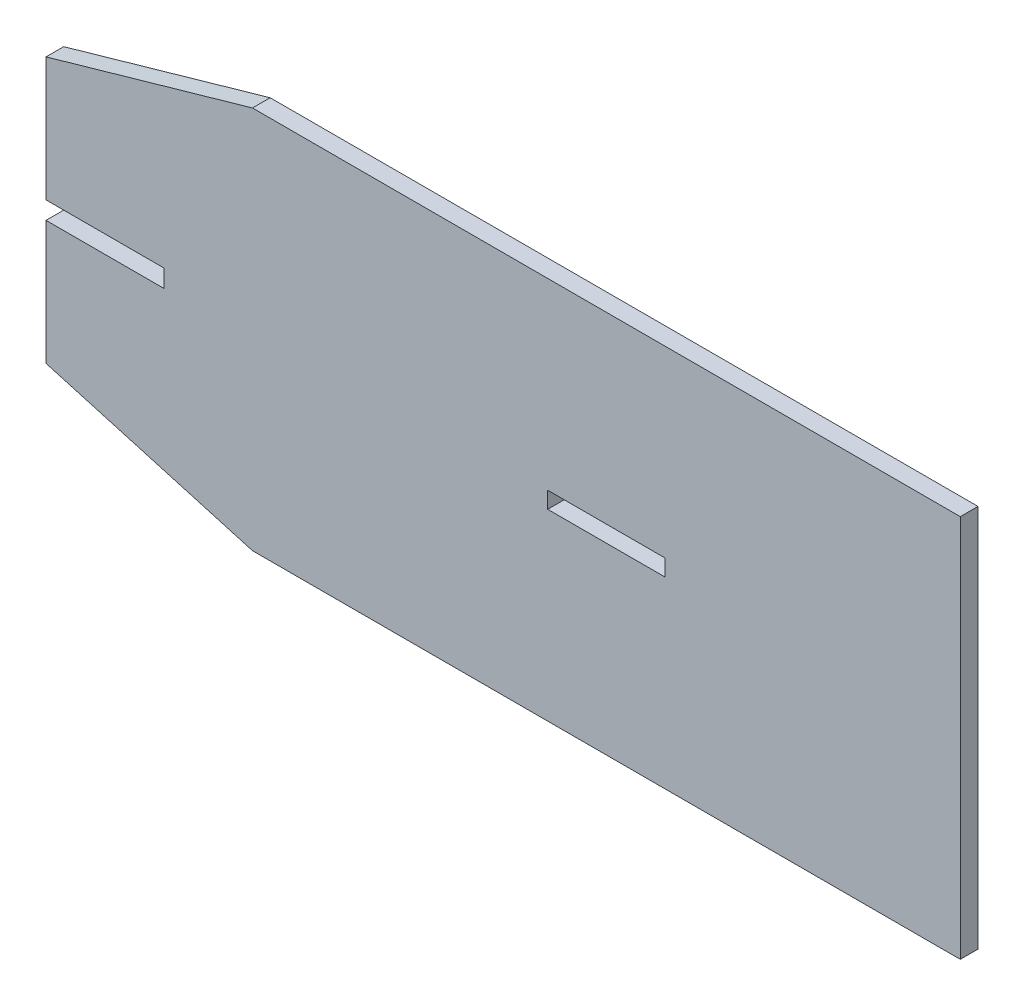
ISO-10303-21;
HEADER;
FILE_DESCRIPTION(('STEP AP214'),'2;1');
FILE_NAME('part.step','',(''),(''),'','','');
FILE_SCHEMA(('AUTOMOTIVE_DESIGN { 1 0 10303 214 1 1 1 1 }'));
ENDSEC;
DATA;
#1=APPLICATION_CONTEXT('core data for automotive mechanical design processes');
#2=APPLICATION_PROTOCOL_DEFINITION('international standard','automotive_design',2000,#1);
#3=PRODUCT_CONTEXT('',#1,'mechanical');
#4=PRODUCT('Part','Part','',(#3));
#5=PRODUCT_RELATED_PRODUCT_CATEGORY('part','',(#4));
#6=PRODUCT_DEFINITION_FORMATION('','',#4);
#7=PRODUCT_DEFINITION_CONTEXT('part definition',#1,'design');
#8=PRODUCT_DEFINITION('design','',#6,#7);
#9=PRODUCT_DEFINITION_SHAPE('','',#8);
#10=(LENGTH_UNIT() NAMED_UNIT(*) SI_UNIT(.MILLI.,.METRE.));
#11=(NAMED_UNIT(*) PLANE_ANGLE_UNIT() SI_UNIT($,.RADIAN.));
#12=(NAMED_UNIT(*) SI_UNIT($,.STERADIAN.) SOLID_ANGLE_UNIT());
#13=UNCERTAINTY_MEASURE_WITH_UNIT(LENGTH_MEASURE(1.E-05),#10,'distance_accuracy_value','');
#14=(GEOMETRIC_REPRESENTATION_CONTEXT(3) GLOBAL_UNCERTAINTY_ASSIGNED_CONTEXT((#13)) GLOBAL_UNIT_ASSIGNED_CONTEXT((#10,
#11,#12)) REPRESENTATION_CONTEXT('',''));
#15=CARTESIAN_POINT('',(0.,0.,0.));
#16=DIRECTION('',(0.,0.,1.));
#17=DIRECTION('',(1.,0.,0.));
#18=AXIS2_PLACEMENT_3D('',#15,#16,#17);
#19=CARTESIAN_POINT('',(60.,32.5,3.));
#20=DIRECTION('',(0.,-1.,0.));
#21=DIRECTION('',(1.,0.,0.));
#22=AXIS2_PLACEMENT_3D('',#19,#20,#21);
#23=PLANE('',#22);
#24=DIRECTION('',(-1.,0.,0.));
#25=VECTOR('',#24,1.);
#26=CARTESIAN_POINT('',(60.,32.5,0.));
#27=LINE('',#26,#25);
#28=CARTESIAN_POINT('',(60.,32.5,0.));
#29=VERTEX_POINT('',#28);
#30=CARTESIAN_POINT('',(-60.,32.5,0.));
#31=VERTEX_POINT('',#30);
#32=EDGE_CURVE('E175',#29,#31,#27,.T.);
#33=ORIENTED_EDGE('',*,*,#32,.T.);
#34=DIRECTION('',(0.,0.,-1.));
#35=VECTOR('',#34,1.);
#36=CARTESIAN_POINT('',(-60.,32.5,3.));
#37=LINE('',#36,#35);
#38=CARTESIAN_POINT('',(-60.,32.5,3.));
#39=VERTEX_POINT('',#38);
#40=EDGE_CURVE('E11',#39,#31,#37,.T.);
#41=ORIENTED_EDGE('',*,*,#40,.F.);
#42=DIRECTION('',(-1.,0.,0.));
#43=VECTOR('',#42,1.);
#44=CARTESIAN_POINT('',(60.,32.5,3.));
#45=LINE('',#44,#43);
#46=CARTESIAN_POINT('',(60.,32.5,3.));
#47=VERTEX_POINT('',#46);
#48=EDGE_CURVE('E176',#47,#39,#45,.T.);
#49=ORIENTED_EDGE('',*,*,#48,.F.);
#50=DIRECTION('',(0.,0.,-1.));
#51=VECTOR('',#50,1.);
#52=CARTESIAN_POINT('',(60.,32.5,3.));
#53=LINE('',#52,#51);
#54=EDGE_CURVE('E196',#47,#29,#53,.T.);
#55=ORIENTED_EDGE('',*,*,#54,.T.);
#56=EDGE_LOOP('',(#33,#41,#49,#55));
#57=FACE_BOUND('',#56,.T.);
#58=ADVANCED_FACE('F39',(#57),#23,.F.);
#59=CARTESIAN_POINT('',(-60.,32.5,3.));
#60=DIRECTION('',(0.274721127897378,-0.961523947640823,0.));
#61=DIRECTION('',(0.961523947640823,0.274721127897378,0.));
#62=AXIS2_PLACEMENT_3D('',#59,#60,#61);
#63=PLANE('',#62);
#64=DIRECTION('',(-0.961523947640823,-0.274721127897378,0.));
#65=VECTOR('',#64,1.);
#66=CARTESIAN_POINT('',(-60.,32.5,0.));
#67=LINE('',#66,#65);
#68=CARTESIAN_POINT('',(-95.,22.5,0.));
#69=VERTEX_POINT('',#68);
#70=EDGE_CURVE('E203',#31,#69,#67,.T.);
#71=ORIENTED_EDGE('',*,*,#70,.T.);
#72=DIRECTION('',(0.,0.,-1.));
#73=VECTOR('',#72,1.);
#74=CARTESIAN_POINT('',(-95.,22.5,3.));
#75=LINE('',#74,#73);
#76=CARTESIAN_POINT('',(-95.,22.5,3.));
#77=VERTEX_POINT('',#76);
#78=EDGE_CURVE('E46',#77,#69,#75,.T.);
#79=ORIENTED_EDGE('',*,*,#78,.F.);
#80=DIRECTION('',(-0.961523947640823,-0.274721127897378,0.));
#81=VECTOR('',#80,1.);
#82=CARTESIAN_POINT('',(-60.,32.5,3.));
#83=LINE('',#82,#81);
#84=EDGE_CURVE('E178',#39,#77,#83,.T.);
#85=ORIENTED_EDGE('',*,*,#84,.F.);
#86=ORIENTED_EDGE('',*,*,#40,.T.);
#87=EDGE_LOOP('',(#71,#79,#85,#86));
#88=FACE_BOUND('',#87,.T.);
#89=ADVANCED_FACE('F266',(#88),#63,.F.);
#90=CARTESIAN_POINT('',(-95.,22.5,3.));
#91=DIRECTION('',(1.,0.,0.));
#92=DIRECTION('',(0.,0.,-1.));
#93=AXIS2_PLACEMENT_3D('',#90,#91,#92);
#94=PLANE('',#93);
#95=DIRECTION('',(0.,-1.,0.));
#96=VECTOR('',#95,1.);
#97=CARTESIAN_POINT('',(-95.,22.5,0.));
#98=LINE('',#97,#96);
#99=CARTESIAN_POINT('',(-95.,1.50000000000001,0.));
#100=VERTEX_POINT('',#99);
#101=EDGE_CURVE('E201',#69,#100,#98,.T.);
#102=ORIENTED_EDGE('',*,*,#101,.T.);
#103=DIRECTION('',(0.,0.,-1.));
#104=VECTOR('',#103,1.);
#105=CARTESIAN_POINT('',(-95.,1.50000000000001,3.));
#106=LINE('',#105,#104);
#107=CARTESIAN_POINT('',(-95.,1.50000000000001,3.));
#108=VERTEX_POINT('',#107);
#109=EDGE_CURVE('E236',#108,#100,#106,.T.);
#110=ORIENTED_EDGE('',*,*,#109,.F.);
#111=DIRECTION('',(0.,-1.,0.));
#112=VECTOR('',#111,1.);
#113=CARTESIAN_POINT('',(-95.,22.5,3.));
#114=LINE('',#113,#112);
#115=EDGE_CURVE('E185',#77,#108,#114,.T.);
#116=ORIENTED_EDGE('',*,*,#115,.F.);
#117=ORIENTED_EDGE('',*,*,#78,.T.);
#118=EDGE_LOOP('',(#102,#110,#116,#117));
#119=FACE_BOUND('',#118,.T.);
#120=ADVANCED_FACE('F244',(#119),#94,.F.);
#121=CARTESIAN_POINT('',(-95.,1.50000000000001,3.));
#122=DIRECTION('',(0.,1.,0.));
#123=DIRECTION('',(0.,0.,1.));
#124=AXIS2_PLACEMENT_3D('',#121,#122,#123);
#125=PLANE('',#124);
#126=DIRECTION('',(1.,0.,0.));
#127=VECTOR('',#126,1.);
#128=CARTESIAN_POINT('',(-95.,1.50000000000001,0.));
#129=LINE('',#128,#127);
#130=CARTESIAN_POINT('',(-75.,1.50000000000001,0.));
#131=VERTEX_POINT('',#130);
#132=EDGE_CURVE('E202',#100,#131,#129,.T.);
#133=ORIENTED_EDGE('',*,*,#132,.T.);
#134=DIRECTION('',(0.,0.,-1.));
#135=VECTOR('',#134,1.);
#136=CARTESIAN_POINT('',(-75.,1.50000000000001,3.));
#137=LINE('',#136,#135);
#138=CARTESIAN_POINT('',(-75.,1.50000000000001,3.));
#139=VERTEX_POINT('',#138);
#140=EDGE_CURVE('E234',#139,#131,#137,.T.);
#141=ORIENTED_EDGE('',*,*,#140,.F.);
#142=DIRECTION('',(1.,0.,0.));
#143=VECTOR('',#142,1.);
#144=CARTESIAN_POINT('',(-95.,1.50000000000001,3.));
#145=LINE('',#144,#143);
#146=EDGE_CURVE('E184',#108,#139,#145,.T.);
#147=ORIENTED_EDGE('',*,*,#146,.F.);
#148=ORIENTED_EDGE('',*,*,#109,.T.);
#149=EDGE_LOOP('',(#133,#141,#147,#148));
#150=FACE_BOUND('',#149,.T.);
#151=ADVANCED_FACE('F255',(#150),#125,.F.);
#152=CARTESIAN_POINT('',(-75.,1.50000000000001,3.));
#153=DIRECTION('',(1.,0.,0.));
#154=DIRECTION('',(0.,0.,-1.));
#155=AXIS2_PLACEMENT_3D('',#152,#153,#154);
#156=PLANE('',#155);
#157=DIRECTION('',(0.,-1.,0.));
#158=VECTOR('',#157,1.);
#159=CARTESIAN_POINT('',(-75.,1.50000000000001,0.));
#160=LINE('',#159,#158);
#161=CARTESIAN_POINT('',(-75.,-1.49999999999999,0.));
#162=VERTEX_POINT('',#161);
#163=EDGE_CURVE('E210',#131,#162,#160,.T.);
#164=ORIENTED_EDGE('',*,*,#163,.T.);
#165=DIRECTION('',(0.,0.,-1.));
#166=VECTOR('',#165,1.);
#167=CARTESIAN_POINT('',(-75.,-1.49999999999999,3.));
#168=LINE('',#167,#166);
#169=CARTESIAN_POINT('',(-75.,-1.49999999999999,3.));
#170=VERTEX_POINT('',#169);
#171=EDGE_CURVE('E235',#170,#162,#168,.T.);
#172=ORIENTED_EDGE('',*,*,#171,.F.);
#173=DIRECTION('',(0.,-1.,0.));
#174=VECTOR('',#173,1.);
#175=CARTESIAN_POINT('',(-75.,1.50000000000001,3.));
#176=LINE('',#175,#174);
#177=EDGE_CURVE('E186',#139,#170,#176,.T.);
#178=ORIENTED_EDGE('',*,*,#177,.F.);
#179=ORIENTED_EDGE('',*,*,#140,.T.);
#180=EDGE_LOOP('',(#164,#172,#178,#179));
#181=FACE_BOUND('',#180,.T.);
#182=ADVANCED_FACE('F256',(#181),#156,.F.);
#183=CARTESIAN_POINT('',(-95.,-1.49999999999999,3.));
#184=DIRECTION('',(0.,-1.,0.));
#185=DIRECTION('',(1.,0.,0.));
#186=AXIS2_PLACEMENT_3D('',#183,#184,#185);
#187=PLANE('',#186);
#188=DIRECTION('',(-1.,0.,0.));
#189=VECTOR('',#188,1.);
#190=CARTESIAN_POINT('',(-95.,-1.49999999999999,0.));
#191=LINE('',#190,#189);
#192=CARTESIAN_POINT('',(-95.,-1.49999999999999,0.));
#193=VERTEX_POINT('',#192);
#194=EDGE_CURVE('E207',#162,#193,#191,.T.);
#195=ORIENTED_EDGE('',*,*,#194,.T.);
#196=DIRECTION('',(0.,0.,-1.));
#197=VECTOR('',#196,1.);
#198=CARTESIAN_POINT('',(-95.,-1.49999999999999,3.));
#199=LINE('',#198,#197);
#200=CARTESIAN_POINT('',(-95.,-1.49999999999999,3.));
#201=VERTEX_POINT('',#200);
#202=EDGE_CURVE('E228',#201,#193,#199,.T.);
#203=ORIENTED_EDGE('',*,*,#202,.F.);
#204=DIRECTION('',(-1.,0.,0.));
#205=VECTOR('',#204,1.);
#206=CARTESIAN_POINT('',(-95.,-1.49999999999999,3.));
#207=LINE('',#206,#205);
#208=EDGE_CURVE('E187',#170,#201,#207,.T.);
#209=ORIENTED_EDGE('',*,*,#208,.F.);
#210=ORIENTED_EDGE('',*,*,#171,.T.);
#211=EDGE_LOOP('',(#195,#203,#209,#210));
#212=FACE_BOUND('',#211,.T.);
#213=ADVANCED_FACE('F288',(#212),#187,.F.);
#214=CARTESIAN_POINT('',(-95.,-22.5,3.));
#215=DIRECTION('',(1.,0.,0.));
#216=DIRECTION('',(0.,0.,-1.));
#217=AXIS2_PLACEMENT_3D('',#214,#215,#216);
#218=PLANE('',#217);
#219=DIRECTION('',(0.,-1.,0.));
#220=VECTOR('',#219,1.);
#221=CARTESIAN_POINT('',(-95.,-22.5,0.));
#222=LINE('',#221,#220);
#223=CARTESIAN_POINT('',(-95.,-22.5,0.));
#224=VERTEX_POINT('',#223);
#225=EDGE_CURVE('E211',#193,#224,#222,.T.);
#226=ORIENTED_EDGE('',*,*,#225,.T.);
#227=DIRECTION('',(0.,0.,-1.));
#228=VECTOR('',#227,1.);
#229=CARTESIAN_POINT('',(-95.,-22.5,3.));
#230=LINE('',#229,#228);
#231=CARTESIAN_POINT('',(-95.,-22.5,3.));
#232=VERTEX_POINT('',#231);
#233=EDGE_CURVE('E226',#232,#224,#230,.T.);
#234=ORIENTED_EDGE('',*,*,#233,.F.);
#235=DIRECTION('',(0.,-1.,0.));
#236=VECTOR('',#235,1.);
#237=CARTESIAN_POINT('',(-95.,-22.5,3.));
#238=LINE('',#237,#236);
#239=EDGE_CURVE('E189',#201,#232,#238,.T.);
#240=ORIENTED_EDGE('',*,*,#239,.F.);
#241=ORIENTED_EDGE('',*,*,#202,.T.);
#242=EDGE_LOOP('',(#226,#234,#240,#241));
#243=FACE_BOUND('',#242,.T.);
#244=ADVANCED_FACE('F286',(#243),#218,.F.);
#245=CARTESIAN_POINT('',(-60.,-32.5,3.));
#246=DIRECTION('',(0.274721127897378,0.961523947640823,0.));
#247=DIRECTION('',(-0.961523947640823,0.274721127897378,0.));
#248=AXIS2_PLACEMENT_3D('',#245,#246,#247);
#249=PLANE('',#248);
#250=DIRECTION('',(0.961523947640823,-0.274721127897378,0.));
#251=VECTOR('',#250,1.);
#252=CARTESIAN_POINT('',(-60.,-32.5,0.));
#253=LINE('',#252,#251);
#254=CARTESIAN_POINT('',(-60.,-32.5,0.));
#255=VERTEX_POINT('',#254);
#256=EDGE_CURVE('E213',#224,#255,#253,.T.);
#257=ORIENTED_EDGE('',*,*,#256,.T.);
#258=DIRECTION('',(0.,0.,-1.));
#259=VECTOR('',#258,1.);
#260=CARTESIAN_POINT('',(-60.,-32.5,3.));
#261=LINE('',#260,#259);
#262=CARTESIAN_POINT('',(-60.,-32.5,3.));
#263=VERTEX_POINT('',#262);
#264=EDGE_CURVE('E224',#263,#255,#261,.T.);
#265=ORIENTED_EDGE('',*,*,#264,.F.);
#266=DIRECTION('',(0.961523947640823,-0.274721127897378,0.));
#267=VECTOR('',#266,1.);
#268=CARTESIAN_POINT('',(-60.,-32.5,3.));
#269=LINE('',#268,#267);
#270=EDGE_CURVE('E195',#232,#263,#269,.T.);
#271=ORIENTED_EDGE('',*,*,#270,.F.);
#272=ORIENTED_EDGE('',*,*,#233,.T.);
#273=EDGE_LOOP('',(#257,#265,#271,#272));
#274=FACE_BOUND('',#273,.T.);
#275=ADVANCED_FACE('F285',(#274),#249,.F.);
#276=CARTESIAN_POINT('',(60.,-32.5,3.));
#277=DIRECTION('',(0.,1.,0.));
#278=DIRECTION('',(-1.,0.,0.));
#279=AXIS2_PLACEMENT_3D('',#276,#277,#278);
#280=PLANE('',#279);
#281=DIRECTION('',(1.,0.,0.));
#282=VECTOR('',#281,1.);
#283=CARTESIAN_POINT('',(60.,-32.5,0.));
#284=LINE('',#283,#282);
#285=CARTESIAN_POINT('',(60.,-32.5,0.));
#286=VERTEX_POINT('',#285);
#287=EDGE_CURVE('E214',#255,#286,#284,.T.);
#288=ORIENTED_EDGE('',*,*,#287,.T.);
#289=DIRECTION('',(0.,0.,-1.));
#290=VECTOR('',#289,1.);
#291=CARTESIAN_POINT('',(60.,-32.5,3.));
#292=LINE('',#291,#290);
#293=CARTESIAN_POINT('',(60.,-32.5,3.));
#294=VERTEX_POINT('',#293);
#295=EDGE_CURVE('E219',#294,#286,#292,.T.);
#296=ORIENTED_EDGE('',*,*,#295,.F.);
#297=DIRECTION('',(1.,0.,0.));
#298=VECTOR('',#297,1.);
#299=CARTESIAN_POINT('',(60.,-32.5,3.));
#300=LINE('',#299,#298);
#301=EDGE_CURVE('E193',#263,#294,#300,.T.);
#302=ORIENTED_EDGE('',*,*,#301,.F.);
#303=ORIENTED_EDGE('',*,*,#264,.T.);
#304=EDGE_LOOP('',(#288,#296,#302,#303));
#305=FACE_BOUND('',#304,.T.);
#306=ADVANCED_FACE('F279',(#305),#280,.F.);
#307=CARTESIAN_POINT('',(60.,-32.5,3.));
#308=DIRECTION('',(-1.,0.,0.));
#309=DIRECTION('',(0.,-1.,0.));
#310=AXIS2_PLACEMENT_3D('',#307,#308,#309);
#311=PLANE('',#310);
#312=DIRECTION('',(0.,1.,0.));
#313=VECTOR('',#312,1.);
#314=CARTESIAN_POINT('',(60.,-32.5,0.));
#315=LINE('',#314,#313);
#316=EDGE_CURVE('E179',#286,#29,#315,.T.);
#317=ORIENTED_EDGE('',*,*,#316,.T.);
#318=ORIENTED_EDGE('',*,*,#54,.F.);
#319=DIRECTION('',(0.,1.,0.));
#320=VECTOR('',#319,1.);
#321=CARTESIAN_POINT('',(60.,-32.5,3.));
#322=LINE('',#321,#320);
#323=EDGE_CURVE('E198',#294,#47,#322,.T.);
#324=ORIENTED_EDGE('',*,*,#323,.F.);
#325=ORIENTED_EDGE('',*,*,#295,.T.);
#326=EDGE_LOOP('',(#317,#318,#324,#325));
#327=FACE_BOUND('',#326,.T.);
#328=ADVANCED_FACE('F272',(#327),#311,.F.);
#329=CARTESIAN_POINT('',(0.,0.,3.));
#330=DIRECTION('',(0.,0.,1.));
#331=DIRECTION('',(1.,0.,0.));
#332=AXIS2_PLACEMENT_3D('',#329,#330,#331);
#333=PLANE('',#332);
#334=DIRECTION('',(0.,-1.,0.));
#335=VECTOR('',#334,1.);
#336=CARTESIAN_POINT('',(-9.95,-1.4,3.));
#337=LINE('',#336,#335);
#338=CARTESIAN_POINT('',(-9.95,1.4,3.));
#339=VERTEX_POINT('',#338);
#340=CARTESIAN_POINT('',(-9.95,-1.4,3.));
#341=VERTEX_POINT('',#340);
#342=EDGE_CURVE('E52',#339,#341,#337,.T.);
#343=ORIENTED_EDGE('',*,*,#342,.F.);
#344=DIRECTION('',(-1.,0.,0.));
#345=VECTOR('',#344,1.);
#346=CARTESIAN_POINT('',(9.95,1.4,3.));
#347=LINE('',#346,#345);
#348=CARTESIAN_POINT('',(9.95,1.4,3.));
#349=VERTEX_POINT('',#348);
#350=EDGE_CURVE('E160',#349,#339,#347,.T.);
#351=ORIENTED_EDGE('',*,*,#350,.F.);
#352=DIRECTION('',(0.,1.,0.));
#353=VECTOR('',#352,1.);
#354=CARTESIAN_POINT('',(9.95,-1.4,3.));
#355=LINE('',#354,#353);
#356=CARTESIAN_POINT('',(9.95,-1.4,3.));
#357=VERTEX_POINT('',#356);
#358=EDGE_CURVE('E159',#357,#349,#355,.T.);
#359=ORIENTED_EDGE('',*,*,#358,.F.);
#360=DIRECTION('',(1.,0.,0.));
#361=VECTOR('',#360,1.);
#362=CARTESIAN_POINT('',(9.95,-1.4,3.));
#363=LINE('',#362,#361);
#364=EDGE_CURVE('E167',#341,#357,#363,.T.);
#365=ORIENTED_EDGE('',*,*,#364,.F.);
#366=EDGE_LOOP('',(#343,#351,#359,#365));
#367=FACE_BOUND('',#366,.T.);
#368=ORIENTED_EDGE('',*,*,#48,.T.);
#369=ORIENTED_EDGE('',*,*,#84,.T.);
#370=ORIENTED_EDGE('',*,*,#115,.T.);
#371=ORIENTED_EDGE('',*,*,#146,.T.);
#372=ORIENTED_EDGE('',*,*,#177,.T.);
#373=ORIENTED_EDGE('',*,*,#208,.T.);
#374=ORIENTED_EDGE('',*,*,#239,.T.);
#375=ORIENTED_EDGE('',*,*,#270,.T.);
#376=ORIENTED_EDGE('',*,*,#301,.T.);
#377=ORIENTED_EDGE('',*,*,#323,.T.);
#378=EDGE_LOOP('',(#368,#369,#370,#371,#372,#373,#374,#375,#376,#377));
#379=FACE_BOUND('',#378,.T.);
#380=ADVANCED_FACE('F265',(#367,#379),#333,.T.);
#381=CARTESIAN_POINT('',(0.,0.,0.));
#382=DIRECTION('',(0.,0.,1.));
#383=DIRECTION('',(1.,0.,0.));
#384=AXIS2_PLACEMENT_3D('',#381,#382,#383);
#385=PLANE('',#384);
#386=DIRECTION('',(-1.,0.,0.));
#387=VECTOR('',#386,1.);
#388=CARTESIAN_POINT('',(9.95,1.4,0.));
#389=LINE('',#388,#387);
#390=CARTESIAN_POINT('',(9.95,1.4,0.));
#391=VERTEX_POINT('',#390);
#392=CARTESIAN_POINT('',(-9.95,1.4,0.));
#393=VERTEX_POINT('',#392);
#394=EDGE_CURVE('E150',#391,#393,#389,.T.);
#395=ORIENTED_EDGE('',*,*,#394,.T.);
#396=DIRECTION('',(0.,-1.,0.));
#397=VECTOR('',#396,1.);
#398=CARTESIAN_POINT('',(-9.95,-1.4,0.));
#399=LINE('',#398,#397);
#400=CARTESIAN_POINT('',(-9.95,-1.4,0.));
#401=VERTEX_POINT('',#400);
#402=EDGE_CURVE('E143',#393,#401,#399,.T.);
#403=ORIENTED_EDGE('',*,*,#402,.T.);
#404=DIRECTION('',(1.,0.,0.));
#405=VECTOR('',#404,1.);
#406=CARTESIAN_POINT('',(9.95,-1.4,0.));
#407=LINE('',#406,#405);
#408=CARTESIAN_POINT('',(9.95,-1.4,0.));
#409=VERTEX_POINT('',#408);
#410=EDGE_CURVE('E147',#401,#409,#407,.T.);
#411=ORIENTED_EDGE('',*,*,#410,.T.);
#412=DIRECTION('',(0.,1.,0.));
#413=VECTOR('',#412,1.);
#414=CARTESIAN_POINT('',(9.95,-1.4,0.));
#415=LINE('',#414,#413);
#416=EDGE_CURVE('E61',#409,#391,#415,.T.);
#417=ORIENTED_EDGE('',*,*,#416,.T.);
#418=EDGE_LOOP('',(#395,#403,#411,#417));
#419=FACE_BOUND('',#418,.T.);
#420=ORIENTED_EDGE('',*,*,#32,.F.);
#421=ORIENTED_EDGE('',*,*,#316,.F.);
#422=ORIENTED_EDGE('',*,*,#287,.F.);
#423=ORIENTED_EDGE('',*,*,#256,.F.);
#424=ORIENTED_EDGE('',*,*,#225,.F.);
#425=ORIENTED_EDGE('',*,*,#194,.F.);
#426=ORIENTED_EDGE('',*,*,#163,.F.);
#427=ORIENTED_EDGE('',*,*,#132,.F.);
#428=ORIENTED_EDGE('',*,*,#101,.F.);
#429=ORIENTED_EDGE('',*,*,#70,.F.);
#430=EDGE_LOOP('',(#420,#421,#422,#423,#424,#425,#426,#427,#428,#429));
#431=FACE_BOUND('',#430,.T.);
#432=ADVANCED_FACE('F152',(#419,#431),#385,.F.);
#433=CARTESIAN_POINT('',(-9.95,-1.4,0.));
#434=DIRECTION('',(-1.,0.,0.));
#435=DIRECTION('',(0.,0.,1.));
#436=AXIS2_PLACEMENT_3D('',#433,#434,#435);
#437=PLANE('',#436);
#438=ORIENTED_EDGE('',*,*,#342,.T.);
#439=DIRECTION('',(0.,0.,1.));
#440=VECTOR('',#439,1.);
#441=CARTESIAN_POINT('',(-9.95,-1.4,0.));
#442=LINE('',#441,#440);
#443=EDGE_CURVE('E140',#401,#341,#442,.T.);
#444=ORIENTED_EDGE('',*,*,#443,.F.);
#445=ORIENTED_EDGE('',*,*,#402,.F.);
#446=DIRECTION('',(0.,0.,1.));
#447=VECTOR('',#446,1.);
#448=CARTESIAN_POINT('',(-9.95,1.4,0.));
#449=LINE('',#448,#447);
#450=EDGE_CURVE('E168',#393,#339,#449,.T.);
#451=ORIENTED_EDGE('',*,*,#450,.T.);
#452=EDGE_LOOP('',(#438,#444,#445,#451));
#453=FACE_BOUND('',#452,.T.);
#454=ADVANCED_FACE('F138',(#453),#437,.F.);
#455=CARTESIAN_POINT('',(9.95,1.4,0.));
#456=DIRECTION('',(0.,1.,0.));
#457=DIRECTION('',(-1.,0.,0.));
#458=AXIS2_PLACEMENT_3D('',#455,#456,#457);
#459=PLANE('',#458);
#460=ORIENTED_EDGE('',*,*,#350,.T.);
#461=ORIENTED_EDGE('',*,*,#450,.F.);
#462=ORIENTED_EDGE('',*,*,#394,.F.);
#463=DIRECTION('',(0.,0.,1.));
#464=VECTOR('',#463,1.);
#465=CARTESIAN_POINT('',(9.95,1.4,0.));
#466=LINE('',#465,#464);
#467=EDGE_CURVE('E172',#391,#349,#466,.T.);
#468=ORIENTED_EDGE('',*,*,#467,.T.);
#469=EDGE_LOOP('',(#460,#461,#462,#468));
#470=FACE_BOUND('',#469,.T.);
#471=ADVANCED_FACE('F378',(#470),#459,.F.);
#472=CARTESIAN_POINT('',(9.95,-1.4,0.));
#473=DIRECTION('',(1.,0.,0.));
#474=DIRECTION('',(0.,0.,-1.));
#475=AXIS2_PLACEMENT_3D('',#472,#473,#474);
#476=PLANE('',#475);
#477=ORIENTED_EDGE('',*,*,#358,.T.);
#478=ORIENTED_EDGE('',*,*,#467,.F.);
#479=ORIENTED_EDGE('',*,*,#416,.F.);
#480=DIRECTION('',(0.,0.,1.));
#481=VECTOR('',#480,1.);
#482=CARTESIAN_POINT('',(9.95,-1.4,0.));
#483=LINE('',#482,#481);
#484=EDGE_CURVE('E148',#409,#357,#483,.T.);
#485=ORIENTED_EDGE('',*,*,#484,.T.);
#486=EDGE_LOOP('',(#477,#478,#479,#485));
#487=FACE_BOUND('',#486,.T.);
#488=ADVANCED_FACE('F390',(#487),#476,.F.);
#489=CARTESIAN_POINT('',(9.95,-1.4,0.));
#490=DIRECTION('',(0.,-1.,0.));
#491=DIRECTION('',(1.,0.,0.));
#492=AXIS2_PLACEMENT_3D('',#489,#490,#491);
#493=PLANE('',#492);
#494=ORIENTED_EDGE('',*,*,#364,.T.);
#495=ORIENTED_EDGE('',*,*,#484,.F.);
#496=ORIENTED_EDGE('',*,*,#410,.F.);
#497=ORIENTED_EDGE('',*,*,#443,.T.);
#498=EDGE_LOOP('',(#494,#495,#496,#497));
#499=FACE_BOUND('',#498,.T.);
#500=ADVANCED_FACE('F151',(#499),#493,.F.);
#501=CLOSED_SHELL('',(#58,#89,#120,#151,#182,#213,#244,#275,#306,#328,#380,#432,#454,#471,#488,#500));
#502=MANIFOLD_SOLID_BREP('B2',#501);
#503=ADVANCED_BREP_SHAPE_REPRESENTATION('',(#18,#502),#14);
#504=SHAPE_DEFINITION_REPRESENTATION(#9,#503);
ENDSEC;
END-ISO-10303-21;
